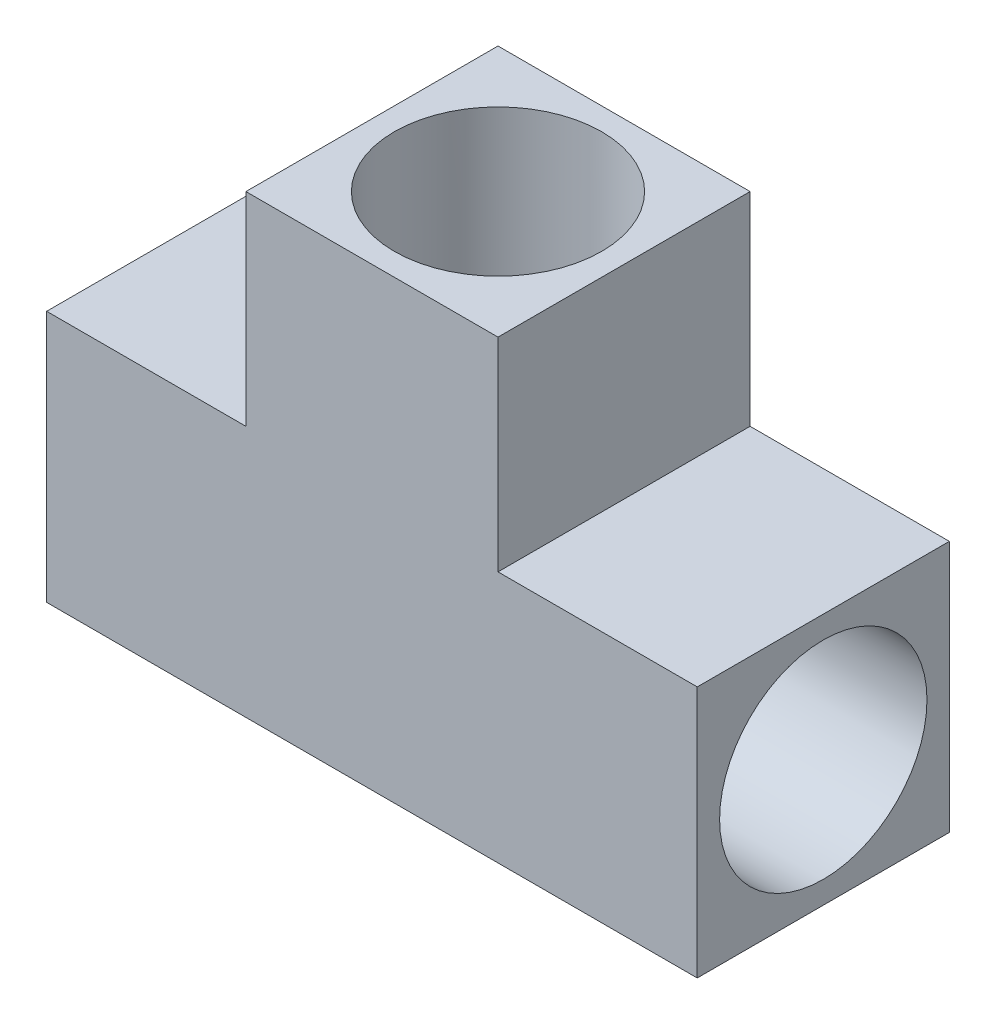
from build123d import *

# Parameters (mm, degrees)
EXTRUDE1_DEPTH     = 7.874
SKETCH2_R          = 3.2385
CUT_EXTRUDE1_DEPTH = 27.023536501
SKETCH4_R          = 3.2385
CUT_EXTRUDE2_DEPTH = 13.5255


with BuildPart() as part:
    # Sketch1 → Extrude1 (new body)
    with BuildSketch(Plane.XY):
        Polygon((-10.16, 0), (-10.16, 7.874), (-3.937, 7.874), (-3.937, 14.224), (3.937, 14.224), (3.937, 7.874), (10.16, 7.874), (10.16, 0), align=None)
    extrude(amount=EXTRUDE1_DEPTH)

    # Sketch2 → Cut-Extrude1 (cut, through all)
    with BuildSketch(Plane.ZY.offset(10.16)):
        with Locations((3.937, 3.937)):
            Circle(SKETCH2_R)
    extrude(amount=-CUT_EXTRUDE1_DEPTH, mode=Mode.SUBTRACT)

    # Sketch4 → Cut-Extrude2 (cut)
    with BuildSketch(Plane(origin=(0, 14.224, 0), x_dir=(-1, 0, 0), z_dir=(0, 1, 0))):
        with Locations(Location((0, 3.937, 0), (0, 0, 90))):
            Circle(SKETCH4_R)
    extrude(amount=-CUT_EXTRUDE2_DEPTH, mode=Mode.SUBTRACT)


solid = part.part
